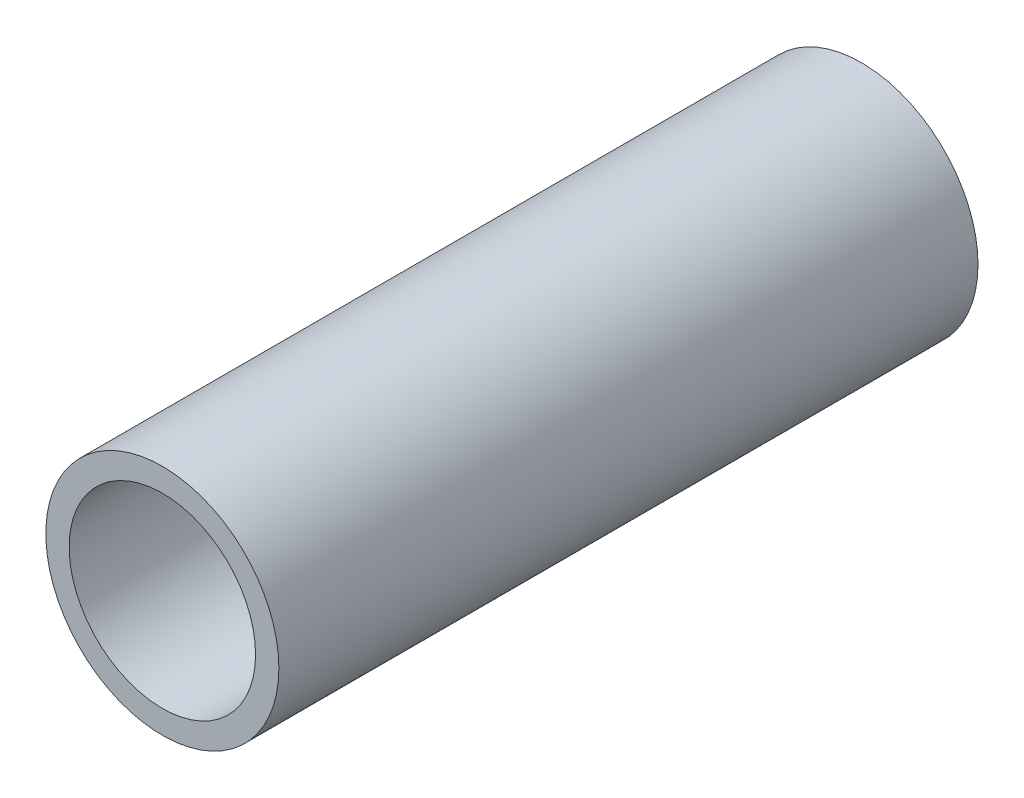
from build123d import *

# Parameters (mm, degrees)
SKETCH1_R           = 5
BOSS_EXTRUDE1_DEPTH = 30
SKETCH2_R           = 4
CUT_EXTRUDE1_DEPTH  = 30


with BuildPart() as part:
    # Sketch1 → Boss-Extrude1 (new body)
    with BuildSketch(Plane.XY):
        Circle(SKETCH1_R)
    extrude(amount=BOSS_EXTRUDE1_DEPTH)

    # Sketch2 → Cut-Extrude1 (cut)
    with BuildSketch(Plane.XY.offset(30)):
        Circle(SKETCH2_R)
    extrude(amount=-CUT_EXTRUDE1_DEPTH, mode=Mode.SUBTRACT)


solid = part.part
